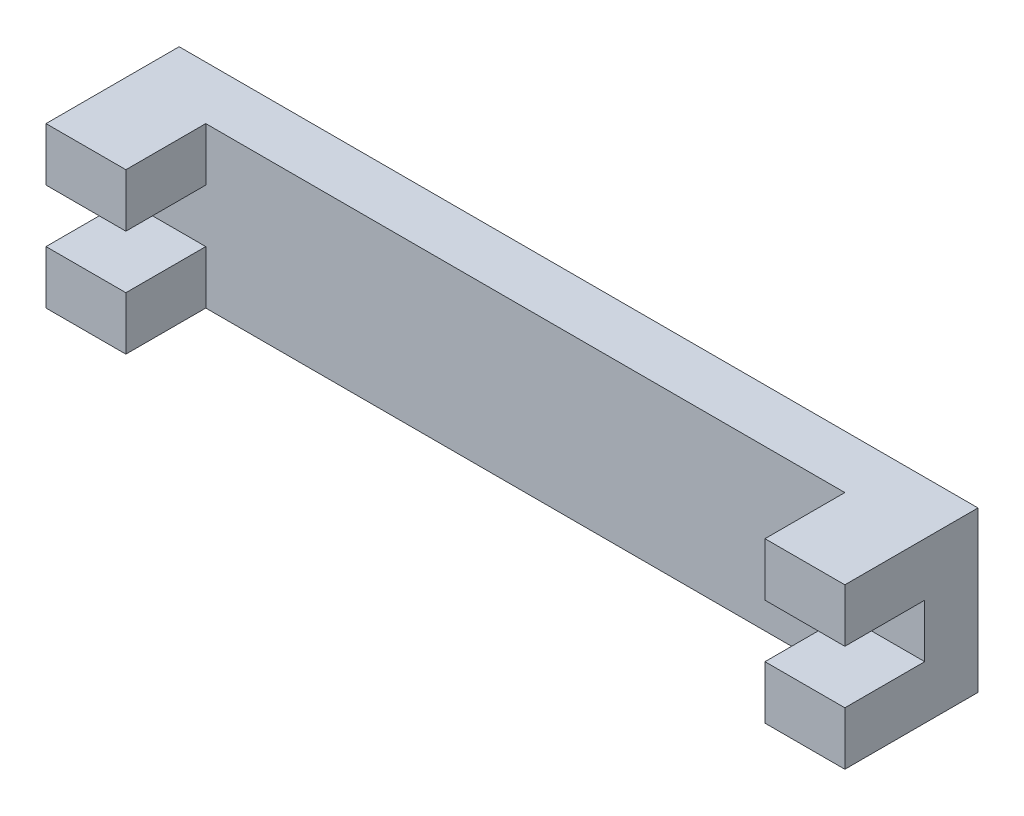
from build123d import *

# Parameters (mm, degrees)
SKIZZE1_W                       = 30
SKIZZE1_H                       = 6
AUFSATZ_LINEAR_AUSTRAGEN1_DEPTH = 2
SKIZZE2_W                       = 3
SKIZZE2_H                       = 2
AUFSATZ_LINEAR_AUSTRAGEN2_DEPTH = 3


with BuildPart() as part:
    # Skizze1 → Aufsatz-Linear austragen1 (new body)
    with BuildSketch(Plane.XY):
        with Locations((15, 3)):
            Rectangle(SKIZZE1_W, SKIZZE1_H)
    extrude(amount=AUFSATZ_LINEAR_AUSTRAGEN1_DEPTH)

    # Skizze2 → Aufsatz-Linear austragen2 (add)
    with BuildSketch(Plane.XY.offset(2)):
        with Locations((1.5, 5)):
            Rectangle(SKIZZE2_W, SKIZZE2_H)
        with Locations((1.5, 1)):
            Rectangle(SKIZZE2_W, SKIZZE2_H)
        with Locations((28.5, 1)):
            Rectangle(SKIZZE2_W, SKIZZE2_H)
        with Locations((28.5, 5)):
            Rectangle(SKIZZE2_W, SKIZZE2_H)
    extrude(amount=AUFSATZ_LINEAR_AUSTRAGEN2_DEPTH)


solid = part.part
